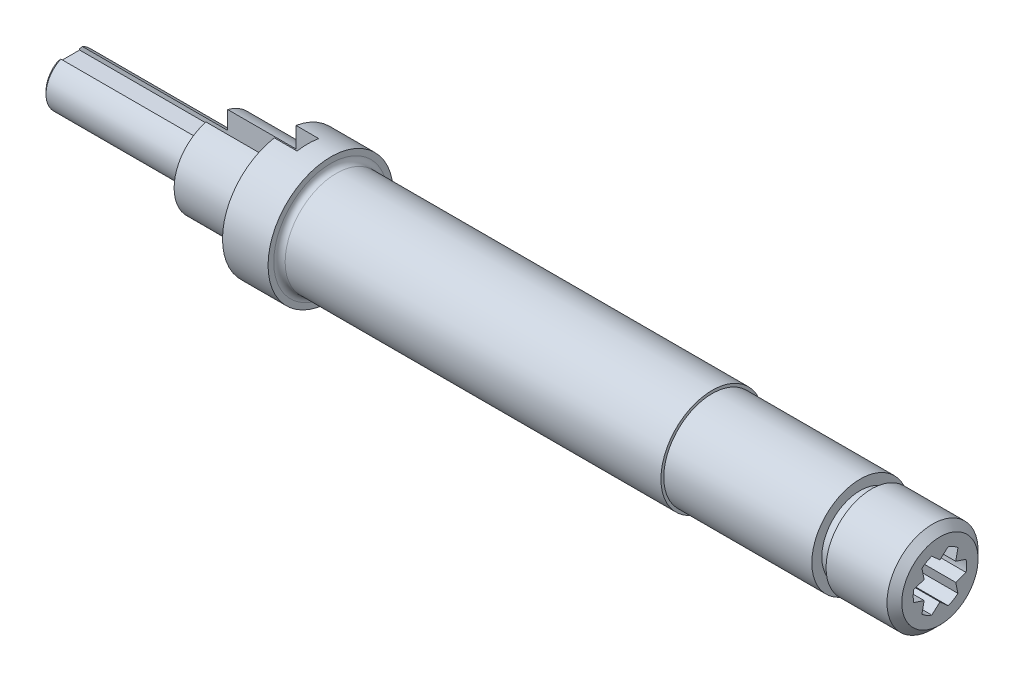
from build123d import *

# Parameters (mm, degrees)
CHANFREIN1_SIZE              = 1.3
CHANFREIN3_SIZE              = 0.5
ENL_V_START                  = -16
ESQUISSE2_W                  = 3.8
ESQUISSE2_H                  = 9
ENL_V_MAT_EXTRU_1_DEPTH      = 47
R_P_TITION_CIRCULAIRE1_COUNT = 2
CONG_2_R                     = 1
ENL_V_MAT_EXTRU_2_DEPTH      = 8.1
R_P_TITION_CIRCULAIRE2_COUNT = 6


with BuildPart() as part:
    # Esquisse1 → Base-R_volution (revolve)
    with BuildSketch(Plane.XY, mode=Mode.PRIVATE) as base_r_volution_sk:
        Polygon((0, 0), (0, 4.5), (26, 4.5), (26, 7.5), (38, 7.5), (38, 11), (46, 11), (46, 9), (113, 9), (113, 8.5), (139, 8.5), (139, 6.75), (141, 6.75), (141, 8), (153, 8), (153, 0), align=None)
    revolve(base_r_volution_sk.sketch.rotate(Axis((-30.003967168, 0, 0), (1, 0, 0)), 90), axis=Axis((-30.003967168, 0, 0), (1, 0, 0)))

    # Chanfrein1
    chanfrein1_edges = [part.edges().sort_by_distance(p)[0] for p in [
        (153, 0, -8),
    ]]
    chamfer(chanfrein1_edges, length=CHANFREIN1_SIZE)

    # Chanfrein3
    chanfrein3_edges = [part.edges().sort_by_distance(p)[0] for p in [
        (0, 0, -4.5),
    ]]
    chamfer(chanfrein3_edges, length=CHANFREIN3_SIZE)

    # Esquisse2 → Enl_v. mat.-Extru.1 (cut)
    with BuildSketch(Plane.ZY.offset(-26).offset(ENL_V_START)):
        with Locations((0, 7.8)):
            Rectangle(ESQUISSE2_W, ESQUISSE2_H)
    enl_v_mat_extru_1 = extrude(amount=ENL_V_MAT_EXTRU_1_DEPTH, mode=Mode.SUBTRACT)

    # R_p_tition circulaire1: Enl_v. mat.-Extru.1 ×2 about axis
    r_p_tition_circulaire1_axis = Axis((0, 0, 0), (1, 0, 0))
    for i in range(1, R_P_TITION_CIRCULAIRE1_COUNT):
        add(enl_v_mat_extru_1.rotate(r_p_tition_circulaire1_axis, i * 360 / R_P_TITION_CIRCULAIRE1_COUNT), mode=Mode.SUBTRACT)

    # Cong_2
    cong_2_edges = [part.edges().sort_by_distance(p)[0] for p in [
        (46, 0, -9),
    ]]
    fillet(cong_2_edges, radius=CONG_2_R)

    # Esquisse3 → Enl_v. mat.-Extru.2 (cut)
    with BuildSketch(Plane(origin=(153, 0, 0), x_dir=(0, 0, -1), z_dir=(1, 0, 0))):
        with BuildLine():
            Line((-2.771281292, 1.6), (-4.592385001, 1))
            ThreePointArc((-4.592385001, 1), (-4.7, 0), (-4.592385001, -1))
            Line((-4.592385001, -1), (-2.771281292, -1.6))
            Line((-2.771281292, -1.6), (0, 0))
            Line((0, 0), (-2.771281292, 1.6))
        make_face()
    enl_v_mat_extru_2 = extrude(amount=-ENL_V_MAT_EXTRU_2_DEPTH, mode=Mode.SUBTRACT)

    # R_p_tition circulaire2: Enl_v. mat.-Extru.2 ×6 about axis
    r_p_tition_circulaire2_axis = Axis((0, 0, 0), (1, 0, 0))
    for i in range(1, R_P_TITION_CIRCULAIRE2_COUNT):
        add(enl_v_mat_extru_2.rotate(r_p_tition_circulaire2_axis, i * 360 / R_P_TITION_CIRCULAIRE2_COUNT), mode=Mode.SUBTRACT)

    # Esquisse5 → Enl_vement de mati_re-R_volution1 (revolve, cut)
    with BuildSketch(Plane.XY, mode=Mode.PRIVATE) as enl_vement_de_mati_re_r_volution1_sk:
        Polygon((3.752887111, 0), (3.752887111, 0.75), (0, 2.5), (0, 0), align=None)
    revolve(enl_vement_de_mati_re_r_volution1_sk.sketch.rotate(Axis((-4.866103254, 0, 0), (1, 0, 0)), 90), axis=Axis((-4.866103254, 0, 0), (1, 0, 0)), mode=Mode.SUBTRACT)


solid = part.part
